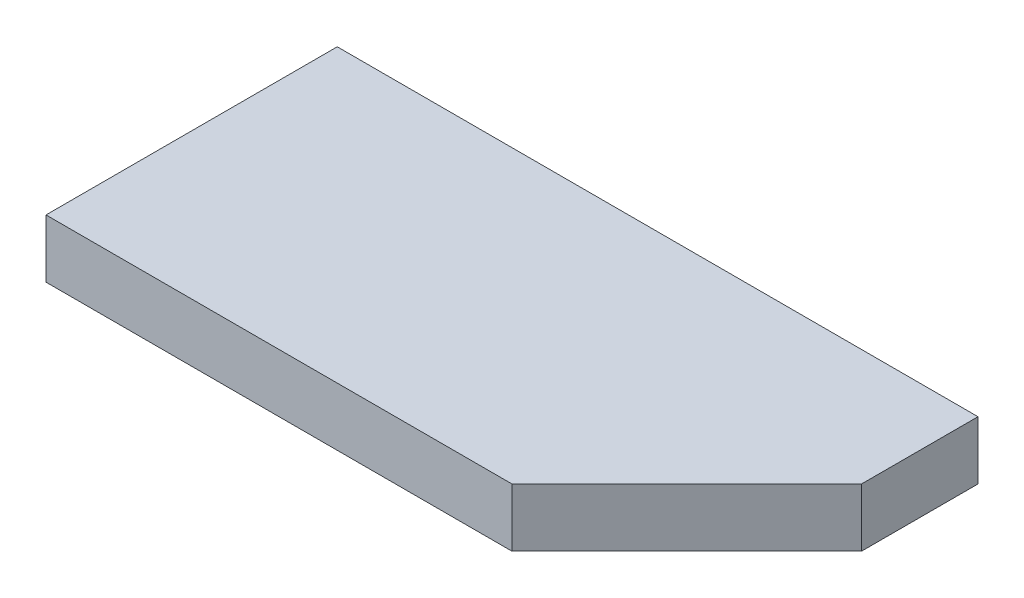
ISO-10303-21;
HEADER;
FILE_DESCRIPTION(('STEP AP214'),'2;1');
FILE_NAME('part.step','',(''),(''),'','','');
FILE_SCHEMA(('AUTOMOTIVE_DESIGN { 1 0 10303 214 1 1 1 1 }'));
ENDSEC;
DATA;
#1=APPLICATION_CONTEXT('core data for automotive mechanical design processes');
#2=APPLICATION_PROTOCOL_DEFINITION('international standard','automotive_design',2000,#1);
#3=PRODUCT_CONTEXT('',#1,'mechanical');
#4=PRODUCT('Part','Part','',(#3));
#5=PRODUCT_RELATED_PRODUCT_CATEGORY('part','',(#4));
#6=PRODUCT_DEFINITION_FORMATION('','',#4);
#7=PRODUCT_DEFINITION_CONTEXT('part definition',#1,'design');
#8=PRODUCT_DEFINITION('design','',#6,#7);
#9=PRODUCT_DEFINITION_SHAPE('','',#8);
#10=(LENGTH_UNIT() NAMED_UNIT(*) SI_UNIT(.MILLI.,.METRE.));
#11=(NAMED_UNIT(*) PLANE_ANGLE_UNIT() SI_UNIT($,.RADIAN.));
#12=(NAMED_UNIT(*) SI_UNIT($,.STERADIAN.) SOLID_ANGLE_UNIT());
#13=UNCERTAINTY_MEASURE_WITH_UNIT(LENGTH_MEASURE(1.E-05),#10,'distance_accuracy_value','');
#14=(GEOMETRIC_REPRESENTATION_CONTEXT(3) GLOBAL_UNCERTAINTY_ASSIGNED_CONTEXT((#13)) GLOBAL_UNIT_ASSIGNED_CONTEXT((#10,
#11,#12)) REPRESENTATION_CONTEXT('',''));
#15=CARTESIAN_POINT('',(0.,0.,0.));
#16=DIRECTION('',(0.,0.,1.));
#17=DIRECTION('',(1.,0.,0.));
#18=AXIS2_PLACEMENT_3D('',#15,#16,#17);
#19=CARTESIAN_POINT('',(0.,5.,-25.));
#20=DIRECTION('',(1.,0.,0.));
#21=DIRECTION('',(0.,0.,-1.));
#22=AXIS2_PLACEMENT_3D('',#19,#20,#21);
#23=PLANE('',#22);
#24=DIRECTION('',(0.,0.,1.));
#25=VECTOR('',#24,1.);
#26=CARTESIAN_POINT('',(0.,0.,-25.));
#27=LINE('',#26,#25);
#28=CARTESIAN_POINT('',(0.,0.,-25.));
#29=VERTEX_POINT('',#28);
#30=CARTESIAN_POINT('',(0.,0.,0.));
#31=VERTEX_POINT('',#30);
#32=EDGE_CURVE('E83',#29,#31,#27,.T.);
#33=ORIENTED_EDGE('',*,*,#32,.T.);
#34=DIRECTION('',(0.,-1.,0.));
#35=VECTOR('',#34,1.);
#36=CARTESIAN_POINT('',(0.,5.,0.));
#37=LINE('',#36,#35);
#38=CARTESIAN_POINT('',(0.,5.,0.));
#39=VERTEX_POINT('',#38);
#40=EDGE_CURVE('E11',#39,#31,#37,.T.);
#41=ORIENTED_EDGE('',*,*,#40,.F.);
#42=DIRECTION('',(0.,0.,1.));
#43=VECTOR('',#42,1.);
#44=CARTESIAN_POINT('',(0.,5.,-25.));
#45=LINE('',#44,#43);
#46=CARTESIAN_POINT('',(0.,5.,-25.));
#47=VERTEX_POINT('',#46);
#48=EDGE_CURVE('E104',#47,#39,#45,.T.);
#49=ORIENTED_EDGE('',*,*,#48,.F.);
#50=DIRECTION('',(0.,-1.,0.));
#51=VECTOR('',#50,1.);
#52=CARTESIAN_POINT('',(0.,5.,-25.));
#53=LINE('',#52,#51);
#54=EDGE_CURVE('E96',#47,#29,#53,.T.);
#55=ORIENTED_EDGE('',*,*,#54,.T.);
#56=EDGE_LOOP('',(#33,#41,#49,#55));
#57=FACE_BOUND('',#56,.T.);
#58=ADVANCED_FACE('F33',(#57),#23,.F.);
#59=CARTESIAN_POINT('',(0.,5.,0.));
#60=DIRECTION('',(0.,0.,-1.));
#61=DIRECTION('',(-1.,0.,0.));
#62=AXIS2_PLACEMENT_3D('',#59,#60,#61);
#63=PLANE('',#62);
#64=DIRECTION('',(1.,0.,0.));
#65=VECTOR('',#64,1.);
#66=CARTESIAN_POINT('',(0.,0.,0.));
#67=LINE('',#66,#65);
#68=CARTESIAN_POINT('',(40.,0.,0.));
#69=VERTEX_POINT('',#68);
#70=EDGE_CURVE('E79',#31,#69,#67,.T.);
#71=ORIENTED_EDGE('',*,*,#70,.T.);
#72=DIRECTION('',(0.,-1.,0.));
#73=VECTOR('',#72,1.);
#74=CARTESIAN_POINT('',(40.,5.,0.));
#75=LINE('',#74,#73);
#76=CARTESIAN_POINT('',(40.,5.,0.));
#77=VERTEX_POINT('',#76);
#78=EDGE_CURVE('E40',#77,#69,#75,.T.);
#79=ORIENTED_EDGE('',*,*,#78,.F.);
#80=DIRECTION('',(1.,0.,0.));
#81=VECTOR('',#80,1.);
#82=CARTESIAN_POINT('',(0.,5.,0.));
#83=LINE('',#82,#81);
#84=EDGE_CURVE('E92',#39,#77,#83,.T.);
#85=ORIENTED_EDGE('',*,*,#84,.F.);
#86=ORIENTED_EDGE('',*,*,#40,.T.);
#87=EDGE_LOOP('',(#71,#79,#85,#86));
#88=FACE_BOUND('',#87,.T.);
#89=ADVANCED_FACE('F91',(#88),#63,.F.);
#90=CARTESIAN_POINT('',(40.,5.,0.));
#91=DIRECTION('',(-0.707106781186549,0.,-0.707106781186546));
#92=DIRECTION('',(-0.707106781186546,0.,0.707106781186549));
#93=AXIS2_PLACEMENT_3D('',#90,#91,#92);
#94=PLANE('',#93);
#95=DIRECTION('',(0.707106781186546,0.,-0.707106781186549));
#96=VECTOR('',#95,1.);
#97=CARTESIAN_POINT('',(40.,0.,0.));
#98=LINE('',#97,#96);
#99=CARTESIAN_POINT('',(55.,0.,-15.0000000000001));
#100=VERTEX_POINT('',#99);
#101=EDGE_CURVE('E85',#69,#100,#98,.T.);
#102=ORIENTED_EDGE('',*,*,#101,.T.);
#103=DIRECTION('',(0.,-1.,0.));
#104=VECTOR('',#103,1.);
#105=CARTESIAN_POINT('',(55.,5.,-15.0000000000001));
#106=LINE('',#105,#104);
#107=CARTESIAN_POINT('',(55.,5.,-15.0000000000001));
#108=VERTEX_POINT('',#107);
#109=EDGE_CURVE('E115',#108,#100,#106,.T.);
#110=ORIENTED_EDGE('',*,*,#109,.F.);
#111=DIRECTION('',(0.707106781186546,0.,-0.707106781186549));
#112=VECTOR('',#111,1.);
#113=CARTESIAN_POINT('',(40.,5.,0.));
#114=LINE('',#113,#112);
#115=EDGE_CURVE('E107',#77,#108,#114,.T.);
#116=ORIENTED_EDGE('',*,*,#115,.F.);
#117=ORIENTED_EDGE('',*,*,#78,.T.);
#118=EDGE_LOOP('',(#102,#110,#116,#117));
#119=FACE_BOUND('',#118,.T.);
#120=ADVANCED_FACE('F119',(#119),#94,.F.);
#121=CARTESIAN_POINT('',(55.,5.,-15.0000000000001));
#122=DIRECTION('',(-1.,0.,0.));
#123=DIRECTION('',(0.,0.,1.));
#124=AXIS2_PLACEMENT_3D('',#121,#122,#123);
#125=PLANE('',#124);
#126=DIRECTION('',(0.,0.,-1.));
#127=VECTOR('',#126,1.);
#128=CARTESIAN_POINT('',(55.,0.,-15.0000000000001));
#129=LINE('',#128,#127);
#130=CARTESIAN_POINT('',(55.,0.,-25.));
#131=VERTEX_POINT('',#130);
#132=EDGE_CURVE('E100',#100,#131,#129,.T.);
#133=ORIENTED_EDGE('',*,*,#132,.T.);
#134=DIRECTION('',(0.,-1.,0.));
#135=VECTOR('',#134,1.);
#136=CARTESIAN_POINT('',(55.,5.,-25.));
#137=LINE('',#136,#135);
#138=CARTESIAN_POINT('',(55.,5.,-25.));
#139=VERTEX_POINT('',#138);
#140=EDGE_CURVE('E112',#139,#131,#137,.T.);
#141=ORIENTED_EDGE('',*,*,#140,.F.);
#142=DIRECTION('',(0.,0.,-1.));
#143=VECTOR('',#142,1.);
#144=CARTESIAN_POINT('',(55.,5.,-15.0000000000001));
#145=LINE('',#144,#143);
#146=EDGE_CURVE('E52',#108,#139,#145,.T.);
#147=ORIENTED_EDGE('',*,*,#146,.F.);
#148=ORIENTED_EDGE('',*,*,#109,.T.);
#149=EDGE_LOOP('',(#133,#141,#147,#148));
#150=FACE_BOUND('',#149,.T.);
#151=ADVANCED_FACE('F130',(#150),#125,.F.);
#152=CARTESIAN_POINT('',(55.,5.,-25.));
#153=DIRECTION('',(0.,0.,1.));
#154=DIRECTION('',(1.,0.,0.));
#155=AXIS2_PLACEMENT_3D('',#152,#153,#154);
#156=PLANE('',#155);
#157=DIRECTION('',(-1.,0.,0.));
#158=VECTOR('',#157,1.);
#159=CARTESIAN_POINT('',(55.,0.,-25.));
#160=LINE('',#159,#158);
#161=EDGE_CURVE('E102',#131,#29,#160,.T.);
#162=ORIENTED_EDGE('',*,*,#161,.T.);
#163=ORIENTED_EDGE('',*,*,#54,.F.);
#164=DIRECTION('',(-1.,0.,0.));
#165=VECTOR('',#164,1.);
#166=CARTESIAN_POINT('',(55.,5.,-25.));
#167=LINE('',#166,#165);
#168=EDGE_CURVE('E47',#139,#47,#167,.T.);
#169=ORIENTED_EDGE('',*,*,#168,.F.);
#170=ORIENTED_EDGE('',*,*,#140,.T.);
#171=EDGE_LOOP('',(#162,#163,#169,#170));
#172=FACE_BOUND('',#171,.T.);
#173=ADVANCED_FACE('F123',(#172),#156,.F.);
#174=CARTESIAN_POINT('',(0.,5.,0.));
#175=DIRECTION('',(0.,1.,0.));
#176=DIRECTION('',(0.,0.,1.));
#177=AXIS2_PLACEMENT_3D('',#174,#175,#176);
#178=PLANE('',#177);
#179=ORIENTED_EDGE('',*,*,#48,.T.);
#180=ORIENTED_EDGE('',*,*,#84,.T.);
#181=ORIENTED_EDGE('',*,*,#115,.T.);
#182=ORIENTED_EDGE('',*,*,#146,.T.);
#183=ORIENTED_EDGE('',*,*,#168,.T.);
#184=EDGE_LOOP('',(#179,#180,#181,#182,#183));
#185=FACE_BOUND('',#184,.T.);
#186=ADVANCED_FACE('F121',(#185),#178,.T.);
#187=CARTESIAN_POINT('',(0.,0.,0.));
#188=DIRECTION('',(0.,1.,0.));
#189=DIRECTION('',(0.,0.,1.));
#190=AXIS2_PLACEMENT_3D('',#187,#188,#189);
#191=PLANE('',#190);
#192=ORIENTED_EDGE('',*,*,#32,.F.);
#193=ORIENTED_EDGE('',*,*,#161,.F.);
#194=ORIENTED_EDGE('',*,*,#132,.F.);
#195=ORIENTED_EDGE('',*,*,#101,.F.);
#196=ORIENTED_EDGE('',*,*,#70,.F.);
#197=EDGE_LOOP('',(#192,#193,#194,#195,#196));
#198=FACE_BOUND('',#197,.T.);
#199=ADVANCED_FACE('F80',(#198),#191,.F.);
#200=CLOSED_SHELL('',(#58,#89,#120,#151,#173,#186,#199));
#201=MANIFOLD_SOLID_BREP('B2',#200);
#202=ADVANCED_BREP_SHAPE_REPRESENTATION('',(#18,#201),#14);
#203=SHAPE_DEFINITION_REPRESENTATION(#9,#202);
ENDSEC;
END-ISO-10303-21;
